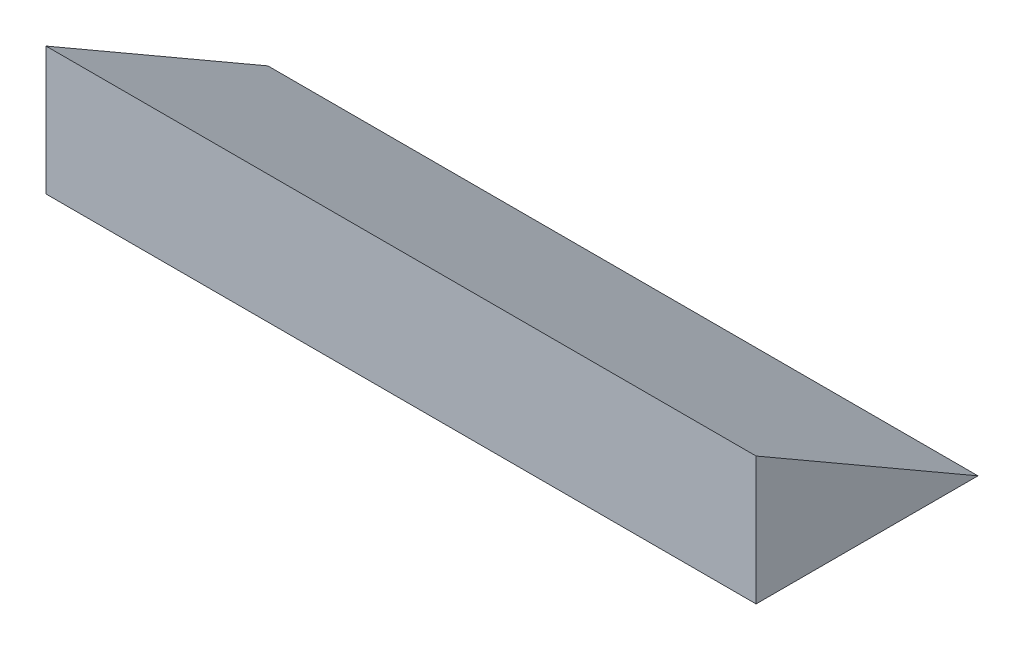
ISO-10303-21;
HEADER;
FILE_DESCRIPTION(('STEP AP214'),'2;1');
FILE_NAME('part.step','',(''),(''),'','','');
FILE_SCHEMA(('AUTOMOTIVE_DESIGN { 1 0 10303 214 1 1 1 1 }'));
ENDSEC;
DATA;
#1=APPLICATION_CONTEXT('core data for automotive mechanical design processes');
#2=APPLICATION_PROTOCOL_DEFINITION('international standard','automotive_design',2000,#1);
#3=PRODUCT_CONTEXT('',#1,'mechanical');
#4=PRODUCT('Part','Part','',(#3));
#5=PRODUCT_RELATED_PRODUCT_CATEGORY('part','',(#4));
#6=PRODUCT_DEFINITION_FORMATION('','',#4);
#7=PRODUCT_DEFINITION_CONTEXT('part definition',#1,'design');
#8=PRODUCT_DEFINITION('design','',#6,#7);
#9=PRODUCT_DEFINITION_SHAPE('','',#8);
#10=(LENGTH_UNIT() NAMED_UNIT(*) SI_UNIT(.MILLI.,.METRE.));
#11=(NAMED_UNIT(*) PLANE_ANGLE_UNIT() SI_UNIT($,.RADIAN.));
#12=(NAMED_UNIT(*) SI_UNIT($,.STERADIAN.) SOLID_ANGLE_UNIT());
#13=UNCERTAINTY_MEASURE_WITH_UNIT(LENGTH_MEASURE(1.E-05),#10,'distance_accuracy_value','');
#14=(GEOMETRIC_REPRESENTATION_CONTEXT(3) GLOBAL_UNCERTAINTY_ASSIGNED_CONTEXT((#13)) GLOBAL_UNIT_ASSIGNED_CONTEXT((#10,
#11,#12)) REPRESENTATION_CONTEXT('',''));
#15=CARTESIAN_POINT('',(0.,0.,0.));
#16=DIRECTION('',(0.,0.,1.));
#17=DIRECTION('',(1.,0.,0.));
#18=AXIS2_PLACEMENT_3D('',#15,#16,#17);
#19=CARTESIAN_POINT('',(1600.,0.,0.));
#20=DIRECTION('',(0.,0.,-1.));
#21=DIRECTION('',(-1.,0.,0.));
#22=AXIS2_PLACEMENT_3D('',#19,#20,#21);
#23=PLANE('',#22);
#24=DIRECTION('',(0.,-1.,0.));
#25=VECTOR('',#24,1.);
#26=CARTESIAN_POINT('',(0.,0.,0.));
#27=LINE('',#26,#25);
#28=CARTESIAN_POINT('',(0.,288.675134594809,0.));
#29=VERTEX_POINT('',#28);
#30=CARTESIAN_POINT('',(0.,0.,0.));
#31=VERTEX_POINT('',#30);
#32=EDGE_CURVE('E79',#29,#31,#27,.T.);
#33=ORIENTED_EDGE('',*,*,#32,.T.);
#34=DIRECTION('',(-1.,0.,0.));
#35=VECTOR('',#34,1.);
#36=CARTESIAN_POINT('',(1600.,0.,0.));
#37=LINE('',#36,#35);
#38=CARTESIAN_POINT('',(1600.,0.,0.));
#39=VERTEX_POINT('',#38);
#40=EDGE_CURVE('E11',#39,#31,#37,.T.);
#41=ORIENTED_EDGE('',*,*,#40,.F.);
#42=DIRECTION('',(0.,-1.,0.));
#43=VECTOR('',#42,1.);
#44=CARTESIAN_POINT('',(1600.,0.,0.));
#45=LINE('',#44,#43);
#46=CARTESIAN_POINT('',(1600.,288.675134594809,0.));
#47=VERTEX_POINT('',#46);
#48=EDGE_CURVE('E72',#47,#39,#45,.T.);
#49=ORIENTED_EDGE('',*,*,#48,.F.);
#50=DIRECTION('',(-1.,0.,0.));
#51=VECTOR('',#50,1.);
#52=CARTESIAN_POINT('',(1600.,288.675134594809,0.));
#53=LINE('',#52,#51);
#54=EDGE_CURVE('E80',#47,#29,#53,.T.);
#55=ORIENTED_EDGE('',*,*,#54,.T.);
#56=EDGE_LOOP('',(#33,#41,#49,#55));
#57=FACE_BOUND('',#56,.T.);
#58=ADVANCED_FACE('F32',(#57),#23,.F.);
#59=CARTESIAN_POINT('',(1600.,0.,0.));
#60=DIRECTION('',(0.,1.,0.));
#61=DIRECTION('',(0.,0.,1.));
#62=AXIS2_PLACEMENT_3D('',#59,#60,#61);
#63=PLANE('',#62);
#64=CARTESIAN_POINT('',(1050.,0.,-250.));
#65=DIRECTION('',(0.,-1.,0.));
#66=DIRECTION('',(0.,0.,1.));
#67=AXIS2_PLACEMENT_3D('',#64,#65,#66);
#68=CIRCLE('',#67,5.00000000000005);
#69=CARTESIAN_POINT('',(1050.,0.,-245.));
#70=VERTEX_POINT('',#69);
#71=EDGE_CURVE('E116',#70,#70,#68,.T.);
#72=ORIENTED_EDGE('',*,*,#71,.F.);
#73=EDGE_LOOP('',(#72));
#74=FACE_BOUND('',#73,.T.);
#75=CARTESIAN_POINT('',(550.,0.,-250.));
#76=DIRECTION('',(0.,-1.,0.));
#77=DIRECTION('',(0.,0.,-1.));
#78=AXIS2_PLACEMENT_3D('',#75,#76,#77);
#79=CIRCLE('',#78,5.00000000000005);
#80=CARTESIAN_POINT('',(550.,0.,-255.));
#81=VERTEX_POINT('',#80);
#82=EDGE_CURVE('E86',#81,#81,#79,.T.);
#83=ORIENTED_EDGE('',*,*,#82,.F.);
#84=EDGE_LOOP('',(#83));
#85=FACE_BOUND('',#84,.T.);
#86=DIRECTION('',(0.,0.,-1.));
#87=VECTOR('',#86,1.);
#88=CARTESIAN_POINT('',(0.,0.,0.));
#89=LINE('',#88,#87);
#90=CARTESIAN_POINT('',(0.,0.,-500.));
#91=VERTEX_POINT('',#90);
#92=EDGE_CURVE('E60',#31,#91,#89,.T.);
#93=ORIENTED_EDGE('',*,*,#92,.T.);
#94=DIRECTION('',(-1.,0.,0.));
#95=VECTOR('',#94,1.);
#96=CARTESIAN_POINT('',(1600.,0.,-500.));
#97=LINE('',#96,#95);
#98=CARTESIAN_POINT('',(1600.,0.,-500.));
#99=VERTEX_POINT('',#98);
#100=EDGE_CURVE('E40',#99,#91,#97,.T.);
#101=ORIENTED_EDGE('',*,*,#100,.F.);
#102=DIRECTION('',(0.,0.,-1.));
#103=VECTOR('',#102,1.);
#104=CARTESIAN_POINT('',(1600.,0.,0.));
#105=LINE('',#104,#103);
#106=EDGE_CURVE('E68',#39,#99,#105,.T.);
#107=ORIENTED_EDGE('',*,*,#106,.F.);
#108=ORIENTED_EDGE('',*,*,#40,.T.);
#109=EDGE_LOOP('',(#93,#101,#107,#108));
#110=FACE_BOUND('',#109,.T.);
#111=ADVANCED_FACE('F69',(#74,#85,#110),#63,.F.);
#112=CARTESIAN_POINT('',(1600.,0.,-500.));
#113=DIRECTION('',(0.,-0.866025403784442,0.499999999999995));
#114=DIRECTION('',(0.,-0.499999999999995,-0.866025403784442));
#115=AXIS2_PLACEMENT_3D('',#112,#113,#114);
#116=PLANE('',#115);
#117=DIRECTION('',(0.,0.499999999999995,0.866025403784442));
#118=VECTOR('',#117,1.);
#119=CARTESIAN_POINT('',(0.,0.,-500.));
#120=LINE('',#119,#118);
#121=EDGE_CURVE('E65',#91,#29,#120,.T.);
#122=ORIENTED_EDGE('',*,*,#121,.T.);
#123=ORIENTED_EDGE('',*,*,#54,.F.);
#124=DIRECTION('',(0.,0.499999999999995,0.866025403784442));
#125=VECTOR('',#124,1.);
#126=CARTESIAN_POINT('',(1600.,0.,-500.));
#127=LINE('',#126,#125);
#128=EDGE_CURVE('E48',#99,#47,#127,.T.);
#129=ORIENTED_EDGE('',*,*,#128,.F.);
#130=ORIENTED_EDGE('',*,*,#100,.T.);
#131=EDGE_LOOP('',(#122,#123,#129,#130));
#132=FACE_BOUND('',#131,.T.);
#133=ADVANCED_FACE('F91',(#132),#116,.F.);
#134=CARTESIAN_POINT('',(1600.,0.,0.));
#135=DIRECTION('',(-1.,0.,0.));
#136=DIRECTION('',(0.,0.,1.));
#137=AXIS2_PLACEMENT_3D('',#134,#135,#136);
#138=PLANE('',#137);
#139=ORIENTED_EDGE('',*,*,#48,.T.);
#140=ORIENTED_EDGE('',*,*,#106,.T.);
#141=ORIENTED_EDGE('',*,*,#128,.T.);
#142=EDGE_LOOP('',(#139,#140,#141));
#143=FACE_BOUND('',#142,.T.);
#144=ADVANCED_FACE('F75',(#143),#138,.F.);
#145=CARTESIAN_POINT('',(0.,0.,0.));
#146=DIRECTION('',(-1.,0.,0.));
#147=DIRECTION('',(0.,0.,1.));
#148=AXIS2_PLACEMENT_3D('',#145,#146,#147);
#149=PLANE('',#148);
#150=ORIENTED_EDGE('',*,*,#32,.F.);
#151=ORIENTED_EDGE('',*,*,#121,.F.);
#152=ORIENTED_EDGE('',*,*,#92,.F.);
#153=EDGE_LOOP('',(#150,#151,#152));
#154=FACE_BOUND('',#153,.T.);
#155=ADVANCED_FACE('F92',(#154),#149,.T.);
#156=CARTESIAN_POINT('',(550.,10.,-250.));
#157=DIRECTION('',(0.,-1.,0.));
#158=DIRECTION('',(0.,0.,-1.));
#159=AXIS2_PLACEMENT_3D('',#156,#157,#158);
#160=CYLINDRICAL_SURFACE('',#159,5.00000000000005);
#161=CARTESIAN_POINT('',(550.,10.,-250.));
#162=DIRECTION('',(0.,-1.,0.));
#163=DIRECTION('',(0.,0.,-1.));
#164=AXIS2_PLACEMENT_3D('',#161,#162,#163);
#165=CIRCLE('',#164,5.00000000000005);
#166=CARTESIAN_POINT('',(550.,10.,-255.));
#167=VERTEX_POINT('',#166);
#168=EDGE_CURVE('E82',#167,#167,#165,.T.);
#169=ORIENTED_EDGE('',*,*,#168,.F.);
#170=EDGE_LOOP('',(#169));
#171=FACE_BOUND('',#170,.T.);
#172=ORIENTED_EDGE('',*,*,#82,.T.);
#173=EDGE_LOOP('',(#172));
#174=FACE_BOUND('',#173,.T.);
#175=ADVANCED_FACE('F94',(#171,#174),#160,.F.);
#176=CARTESIAN_POINT('',(550.,10.,-250.));
#177=DIRECTION('',(0.,-1.,0.));
#178=DIRECTION('',(0.,0.,-1.));
#179=AXIS2_PLACEMENT_3D('',#176,#177,#178);
#180=PLANE('',#179);
#181=ORIENTED_EDGE('',*,*,#168,.T.);
#182=EDGE_LOOP('',(#181));
#183=FACE_BOUND('',#182,.T.);
#184=ADVANCED_FACE('F100',(#183),#180,.T.);
#185=CARTESIAN_POINT('',(1050.,10.,-250.));
#186=DIRECTION('',(0.,-1.,0.));
#187=DIRECTION('',(0.,0.,-1.));
#188=AXIS2_PLACEMENT_3D('',#185,#186,#187);
#189=CYLINDRICAL_SURFACE('',#188,5.00000000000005);
#190=CARTESIAN_POINT('',(1050.,10.,-250.));
#191=DIRECTION('',(0.,-1.,0.));
#192=DIRECTION('',(0.,0.,1.));
#193=AXIS2_PLACEMENT_3D('',#190,#191,#192);
#194=CIRCLE('',#193,5.00000000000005);
#195=CARTESIAN_POINT('',(1050.,10.,-245.));
#196=VERTEX_POINT('',#195);
#197=EDGE_CURVE('E120',#196,#196,#194,.T.);
#198=ORIENTED_EDGE('',*,*,#197,.F.);
#199=EDGE_LOOP('',(#198));
#200=FACE_BOUND('',#199,.T.);
#201=ORIENTED_EDGE('',*,*,#71,.T.);
#202=EDGE_LOOP('',(#201));
#203=FACE_BOUND('',#202,.T.);
#204=ADVANCED_FACE('F126',(#200,#203),#189,.F.);
#205=CARTESIAN_POINT('',(1050.,10.,-250.));
#206=DIRECTION('',(0.,1.,0.));
#207=DIRECTION('',(0.,0.,1.));
#208=AXIS2_PLACEMENT_3D('',#205,#206,#207);
#209=PLANE('',#208);
#210=ORIENTED_EDGE('',*,*,#197,.T.);
#211=EDGE_LOOP('',(#210));
#212=FACE_BOUND('',#211,.T.);
#213=ADVANCED_FACE('F128',(#212),#209,.F.);
#214=CLOSED_SHELL('',(#58,#111,#133,#144,#155,#175,#184,#204,#213));
#215=MANIFOLD_SOLID_BREP('B2',#214);
#216=ADVANCED_BREP_SHAPE_REPRESENTATION('',(#18,#215),#14);
#217=SHAPE_DEFINITION_REPRESENTATION(#9,#216);
ENDSEC;
END-ISO-10303-21;
